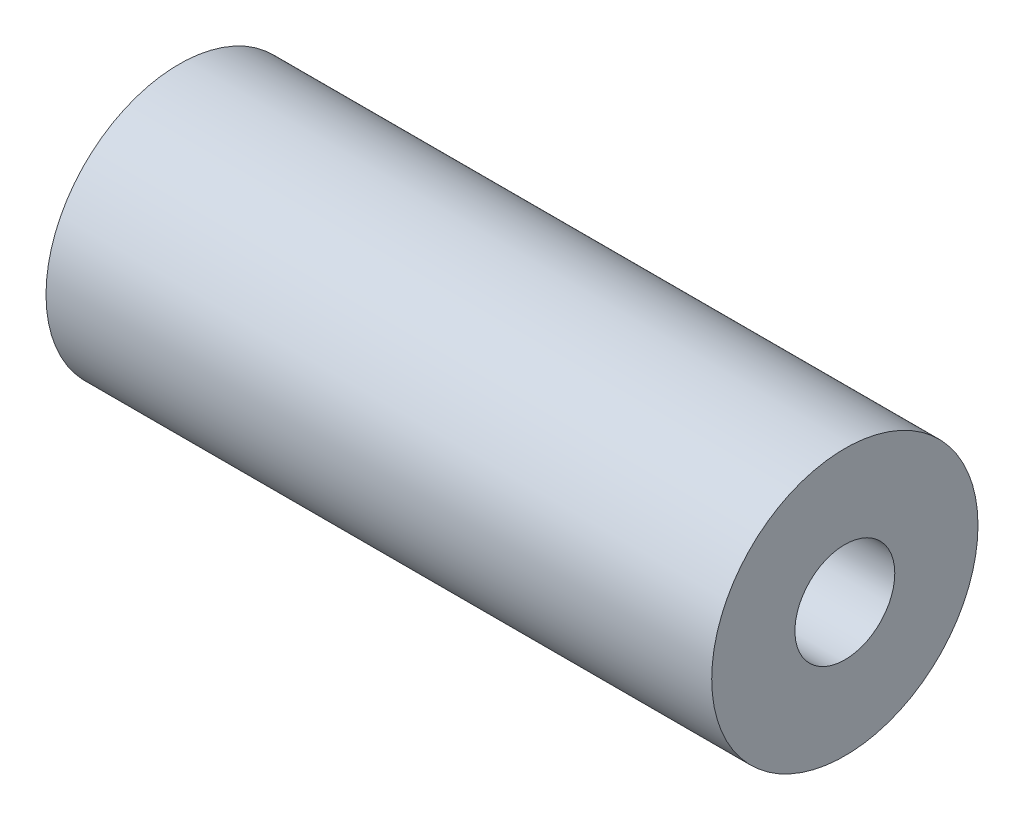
from build123d import *

# Parameters (mm, degrees)
SKETCH1_R      = 12.7
SKETCH1_R_2    = 4.7625
EXTRUDE1_DEPTH = 63.5


with BuildPart() as part:
    # Sketch1 → Extrude1 (new body)
    with BuildSketch(Plane(origin=(0, 0, 0), x_dir=(0, 0, -1), z_dir=(1, 0, 0))):
        Circle(SKETCH1_R)
        Circle(SKETCH1_R_2, mode=Mode.SUBTRACT)
    extrude(amount=EXTRUDE1_DEPTH)


solid = part.part
